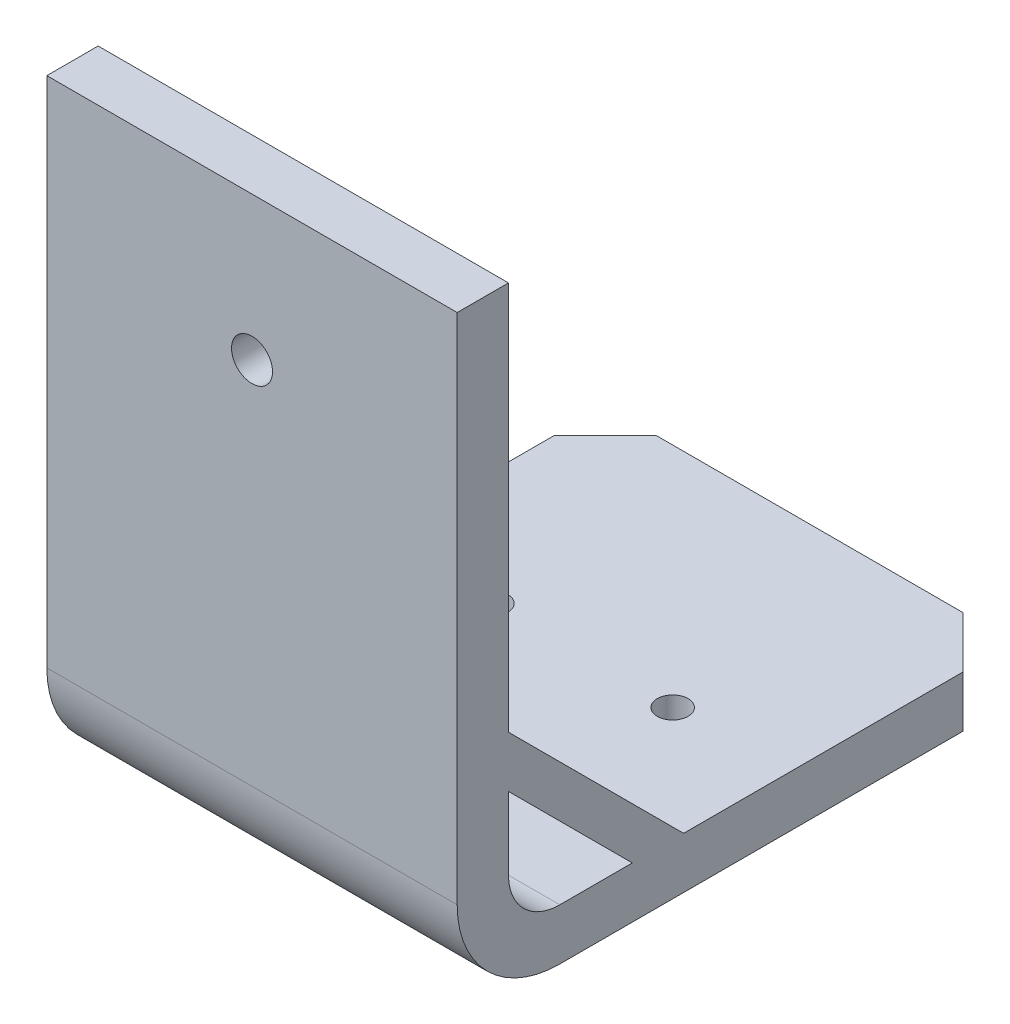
from build123d import *

# Parameters (mm, degrees)
BOSS_EXTRUDE1_DEPTH = 5
SKETCH2_R           = 1.5
CUT_EXTRUDE1_DEPTH  = 5
SKETCH1_4_OUTSIDE_W = 53.856
SKETCH1_4_OUTSIDE_H = 58.288
SKETCH1_4_OUTSIDE_R = 1.5
CUT_EXTRUDE3_DEPTH  = 31.230173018
BOSS_EXTRUDE2_DEPTH = 40
SKETCH5_W           = 5
SKETCH5_H           = 50
BOSS_EXTRUDE3_DEPTH = 40
BOSS_EXTRUDE4_DEPTH = 40
SKETCH9_R           = 2
CUT_EXTRUDE4_DEPTH  = 84.384553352


with BuildPart() as part:
    # Sketch1 → Boss-Extrude1 (new body)
    with BuildSketch(Plane(origin=(0, 0, 0), x_dir=(1, 0, 0), z_dir=(0, 1, 0))):
        Polygon((-14.94438846, 22.160431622), (14.94438846, 22.160431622), (19.94438846, 17.160431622), (19.94438846, -22.160431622), (-19.94438846, -22.160431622), (-19.94438846, 17.160431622), align=None)
    extrude(amount=BOSS_EXTRUDE1_DEPTH)

    # Sketch2 → Cut-Extrude1 (cut)
    with BuildSketch(Plane.XZ):
        with Locations(Location((-8.780710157, 0, 0), (0, 0, 270))):
            Circle(SKETCH2_R)
    extrude(amount=-CUT_EXTRUDE1_DEPTH, mode=Mode.SUBTRACT)

    # Sketch1_4 outside → Cut-Extrude3 (cut, through all)
    # profile 1 of 3: a face of its own
    with BuildSketch(Plane(origin=(0, 0, 0), x_dir=(1, 0, 0), z_dir=(0, 1, 0))):
        Rectangle(SKETCH1_4_OUTSIDE_W, SKETCH1_4_OUTSIDE_H)
        Polygon((-14.94438846, 22.160431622), (14.94438846, 22.160431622), (19.94438846, 17.160431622), (19.94438846, -22.160431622), (-19.94438846, -22.160431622), (-19.94438846, 17.160431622), align=None, mode=Mode.SUBTRACT)
    # profile 2 of 3: a face of its own
    with BuildSketch(Plane(origin=(0, 0, 0), x_dir=(1, 0, 0), z_dir=(0, 1, 0))):
        with Locations(Location((8.788189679, 0, 0), (0, 0, 270))):
            Circle(SKETCH1_4_OUTSIDE_R)
    # profile 3 of 3: a face of its own
    with BuildSketch(Plane(origin=(0, 0, 0), x_dir=(1, 0, 0), z_dir=(0, 1, 0))):
        with Locations((-8.788189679, 0)):
            Circle(SKETCH1_4_OUTSIDE_R)
    extrude(amount=CUT_EXTRUDE3_DEPTH, mode=Mode.SUBTRACT)

    # Sketch4 → Boss-Extrude2 (add)
    with BuildSketch(Plane(origin=(19.94438846, 0, 0), x_dir=(0, 0, -1), z_dir=(1, 0, 0))):
        with BuildLine():
            Line((-22.160431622, 5), (-22.160431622, 0))
            ThreePointArc((-22.160431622, 0), (-29.231499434, 2.928932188), (-32.160431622, 10))
            Line((-32.160431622, 10), (-27.160431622, 10))
            ThreePointArc((-27.160431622, 10), (-25.695965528, 6.464466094), (-22.160431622, 5))
        make_face()
    extrude(amount=-BOSS_EXTRUDE2_DEPTH)

    # Sketch5 → Boss-Extrude3 (add)
    with BuildSketch(Plane(origin=(19.94438846, 0, 0), x_dir=(0, 0, -1), z_dir=(1, 0, 0))):
        with Locations((-29.660431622, 35)):
            Rectangle(SKETCH5_W, SKETCH5_H)
    extrude(amount=-BOSS_EXTRUDE3_DEPTH)

    # Sketch6 → Boss-Extrude4 (add)
    with BuildSketch(Plane(origin=(19.94438846, 0, 0), x_dir=(0, 0, -1), z_dir=(1, 0, 0))):
        Polygon((-10.08936381, 5), (-18.624897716, 13.535533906), (-27.160431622, 22.071067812), (-27.160431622, 17.071067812), (-15.08936381, 5), align=None)
    extrude(amount=-BOSS_EXTRUDE4_DEPTH)

    # Sketch9 → Cut-Extrude4 (cut, through all)
    with BuildSketch(Plane.XY.offset(32.160431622)):
        with Locations((-0.05561154, 46)):
            Circle(SKETCH9_R)
    extrude(amount=-CUT_EXTRUDE4_DEPTH, mode=Mode.SUBTRACT)


solid = part.part
